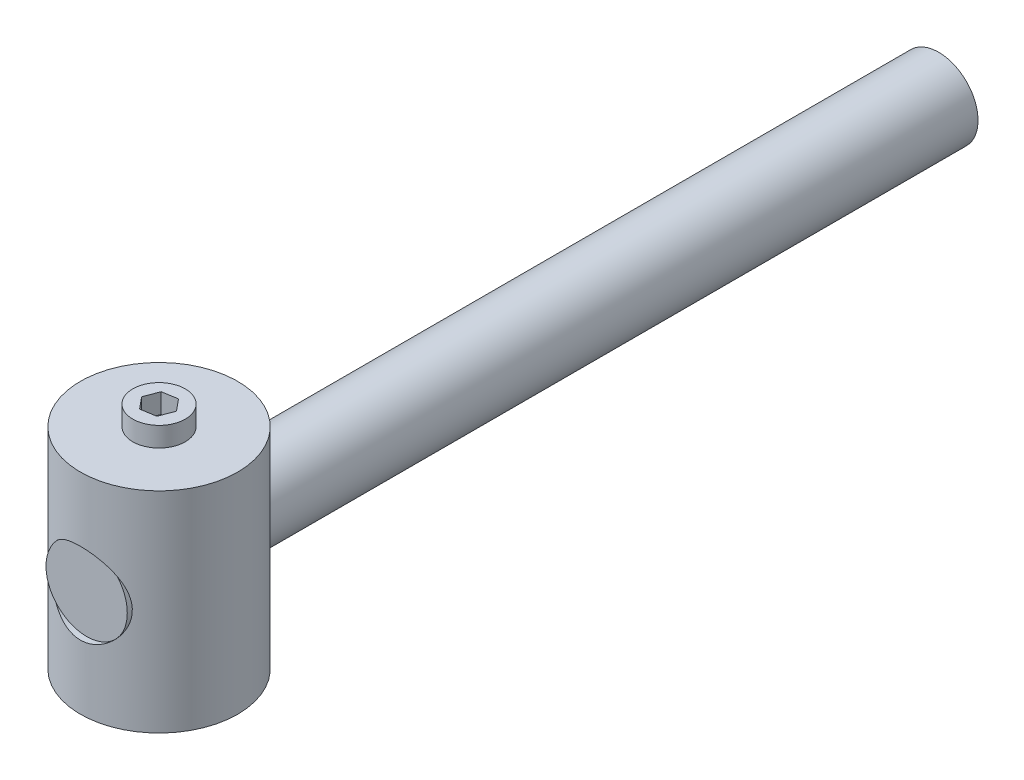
ISO-10303-21;
HEADER;
FILE_DESCRIPTION(('STEP AP214'),'2;1');
FILE_NAME('part.step','',(''),(''),'','','');
FILE_SCHEMA(('AUTOMOTIVE_DESIGN { 1 0 10303 214 1 1 1 1 }'));
ENDSEC;
DATA;
#1=APPLICATION_CONTEXT('core data for automotive mechanical design processes');
#2=APPLICATION_PROTOCOL_DEFINITION('international standard','automotive_design',2000,#1);
#3=PRODUCT_CONTEXT('',#1,'mechanical');
#4=PRODUCT('Part','Part','',(#3));
#5=PRODUCT_RELATED_PRODUCT_CATEGORY('part','',(#4));
#6=PRODUCT_DEFINITION_FORMATION('','',#4);
#7=PRODUCT_DEFINITION_CONTEXT('part definition',#1,'design');
#8=PRODUCT_DEFINITION('design','',#6,#7);
#9=PRODUCT_DEFINITION_SHAPE('','',#8);
#10=(LENGTH_UNIT() NAMED_UNIT(*) SI_UNIT(.MILLI.,.METRE.));
#11=(NAMED_UNIT(*) PLANE_ANGLE_UNIT() SI_UNIT($,.RADIAN.));
#12=(NAMED_UNIT(*) SI_UNIT($,.STERADIAN.) SOLID_ANGLE_UNIT());
#13=UNCERTAINTY_MEASURE_WITH_UNIT(LENGTH_MEASURE(1.E-05),#10,'distance_accuracy_value','');
#14=(GEOMETRIC_REPRESENTATION_CONTEXT(3) GLOBAL_UNCERTAINTY_ASSIGNED_CONTEXT((#13)) GLOBAL_UNIT_ASSIGNED_CONTEXT((#10,
#11,#12)) REPRESENTATION_CONTEXT('',''));
#15=CARTESIAN_POINT('',(0.,0.,0.));
#16=DIRECTION('',(0.,0.,1.));
#17=DIRECTION('',(1.,0.,0.));
#18=AXIS2_PLACEMENT_3D('',#15,#16,#17);
#19=CARTESIAN_POINT('',(0.,-8.,0.));
#20=DIRECTION('',(0.,1.,0.));
#21=DIRECTION('',(-1.,0.,0.));
#22=AXIS2_PLACEMENT_3D('',#19,#20,#21);
#23=CYLINDRICAL_SURFACE('',#22,6.);
#24=CARTESIAN_POINT('',(0.,-8.,0.));
#25=DIRECTION('',(0.,-1.,0.));
#26=DIRECTION('',(1.,0.,0.));
#27=AXIS2_PLACEMENT_3D('',#24,#25,#26);
#28=CIRCLE('',#27,6.);
#29=CARTESIAN_POINT('',(6.,-8.,0.));
#30=VERTEX_POINT('',#29);
#31=EDGE_CURVE('E170',#30,#30,#28,.T.);
#32=ORIENTED_EDGE('',*,*,#31,.F.);
#33=EDGE_LOOP('',(#32));
#34=FACE_BOUND('',#33,.T.);
#35=CARTESIAN_POINT('',(0.,8.,0.));
#36=DIRECTION('',(0.,-1.,0.));
#37=DIRECTION('',(1.,0.,0.));
#38=AXIS2_PLACEMENT_3D('',#35,#36,#37);
#39=CIRCLE('',#38,6.);
#40=CARTESIAN_POINT('',(6.,8.,0.));
#41=VERTEX_POINT('',#40);
#42=EDGE_CURVE('E139',#41,#41,#39,.T.);
#43=ORIENTED_EDGE('',*,*,#42,.T.);
#44=EDGE_LOOP('',(#43));
#45=FACE_BOUND('',#44,.T.);
#46=CARTESIAN_POINT('',(2.34445537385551,2.02818367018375,5.523));
#47=CARTESIAN_POINT('',(2.28783362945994,2.09362143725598,5.54703549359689));
#48=CARTESIAN_POINT('',(2.22853125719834,2.15664409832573,5.57117975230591));
#49=CARTESIAN_POINT('',(2.10476972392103,2.27759795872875,5.61910633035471));
#50=CARTESIAN_POINT('',(2.04030890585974,2.33552750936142,5.6428885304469));
#51=CARTESIAN_POINT('',(1.83907285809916,2.50161967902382,5.712965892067));
#52=CARTESIAN_POINT('',(1.69485367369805,2.60161177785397,5.75781077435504));
#53=CARTESIAN_POINT('',(1.38936467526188,2.77682642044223,5.83906800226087));
#54=CARTESIAN_POINT('',(1.22804995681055,2.85198148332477,5.87545729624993));
#55=CARTESIAN_POINT('',(0.893089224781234,2.97388918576,5.9355870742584));
#56=CARTESIAN_POINT('',(0.719472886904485,3.02070774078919,5.95935689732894));
#57=CARTESIAN_POINT('',(0.37896811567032,3.08122759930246,5.99027109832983));
#58=CARTESIAN_POINT('',(0.212585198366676,3.09719380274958,5.99855093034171));
#59=CARTESIAN_POINT('',(-0.120731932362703,3.10212575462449,6.00109752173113));
#60=CARTESIAN_POINT('',(-0.287666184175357,3.09108958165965,5.99536328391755));
#61=CARTESIAN_POINT('',(-0.605511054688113,3.04424686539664,5.97135508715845));
#62=CARTESIAN_POINT('',(-0.756745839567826,3.01014968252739,5.95394713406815));
#63=CARTESIAN_POINT('',(-1.05111942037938,2.9204171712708,5.90908886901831));
#64=CARTESIAN_POINT('',(-1.19425548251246,2.86477461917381,5.8816351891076));
#65=CARTESIAN_POINT('',(-1.47577324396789,2.73084859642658,5.8175524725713));
#66=CARTESIAN_POINT('',(-1.61362361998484,2.65163191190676,5.7805558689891));
#67=CARTESIAN_POINT('',(-1.87455844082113,2.4740471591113,5.70128135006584));
#68=CARTESIAN_POINT('',(-1.99765355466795,2.37569306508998,5.65900729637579));
#69=CARTESIAN_POINT('',(-2.15323350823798,2.23085465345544,5.60049150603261));
#70=CARTESIAN_POINT('',(-2.19305136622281,2.19172196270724,5.58500415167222));
#71=CARTESIAN_POINT('',(-2.27043195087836,2.11145322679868,5.55399565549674));
#72=CARTESIAN_POINT('',(-2.30799879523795,2.07032110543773,5.53847463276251));
#73=CARTESIAN_POINT('',(-2.34445537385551,2.02818367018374,5.523));
#74=B_SPLINE_CURVE_WITH_KNOTS('',3,(#46,#47,#48,#49,#50,#51,#52,#53,#54,#55,#56,#57,#58,#59,#60,
#61,#62,#63,#64,#65,#66,#67,#68,#69,#70,#71,#72,#73),.UNSPECIFIED.,.F.,.F.,(4,2,2,2,2,2,2,2,2,2,
2,2,2,4),(0.,0.269274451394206,0.538635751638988,1.07929178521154,1.62140490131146,
2.16225207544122,2.66161136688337,3.16100619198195,3.62693767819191,4.09302551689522,
4.58080576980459,5.06823117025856,5.24198423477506,5.41540909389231),.UNSPECIFIED.);
#75=CARTESIAN_POINT('',(2.34445537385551,2.02818367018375,5.523));
#76=VERTEX_POINT('',#75);
#77=CARTESIAN_POINT('',(-2.34445537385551,2.02818367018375,5.523));
#78=VERTEX_POINT('',#77);
#79=EDGE_CURVE('E9',#76,#78,#74,.T.);
#80=ORIENTED_EDGE('',*,*,#79,.F.);
#81=CARTESIAN_POINT('',(2.34445537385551,2.02818367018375,5.523));
#82=CARTESIAN_POINT('',(2.39916282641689,1.96492519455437,5.49977845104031));
#83=CARTESIAN_POINT('',(2.45131496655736,1.89948269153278,5.476679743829));
#84=CARTESIAN_POINT('',(2.55032402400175,1.76434146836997,5.43128099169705));
#85=CARTESIAN_POINT('',(2.59717562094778,1.69463857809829,5.40898176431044));
#86=CARTESIAN_POINT('',(2.72977964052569,1.47879734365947,5.3439716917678));
#87=CARTESIAN_POINT('',(2.80703731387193,1.32655302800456,5.30338869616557));
#88=CARTESIAN_POINT('',(2.90389845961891,1.08848208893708,5.25059379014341));
#89=CARTESIAN_POINT('',(2.93306480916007,1.00728669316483,5.2343107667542));
#90=CARTESIAN_POINT('',(2.98465339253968,0.84220277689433,5.20506714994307));
#91=CARTESIAN_POINT('',(3.007078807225,0.758315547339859,5.19210498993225));
#92=CARTESIAN_POINT('',(3.04482114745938,0.58872082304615,5.17006210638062));
#93=CARTESIAN_POINT('',(3.06015880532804,0.503019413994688,5.16097006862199));
#94=CARTESIAN_POINT('',(3.08358532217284,0.33029211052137,5.14700781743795));
#95=CARTESIAN_POINT('',(3.0916751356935,0.243266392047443,5.14213704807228));
#96=CARTESIAN_POINT('',(3.10004120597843,0.0772347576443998,5.13709684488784));
#97=CARTESIAN_POINT('',(3.10100294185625,-0.0017249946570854,5.13651499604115));
#98=CARTESIAN_POINT('',(3.09690151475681,-0.159459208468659,5.13898890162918));
#99=CARTESIAN_POINT('',(3.09183623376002,-0.238233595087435,5.14204593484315));
#100=CARTESIAN_POINT('',(3.0757427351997,-0.394988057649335,5.15168855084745));
#101=CARTESIAN_POINT('',(3.06471188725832,-0.472967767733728,5.15827569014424));
#102=CARTESIAN_POINT('',(3.03683586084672,-0.627538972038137,5.17473524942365));
#103=CARTESIAN_POINT('',(3.01998845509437,-0.70412992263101,5.18460892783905));
#104=CARTESIAN_POINT('',(2.96262867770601,-0.92479388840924,5.21773477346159));
#105=CARTESIAN_POINT('',(2.91457832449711,-1.06638392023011,5.24495496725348));
#106=CARTESIAN_POINT('',(2.79952590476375,-1.3396528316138,5.30724920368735));
#107=CARTESIAN_POINT('',(2.73252534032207,-1.47133249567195,5.34232262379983));
#108=CARTESIAN_POINT('',(2.6109347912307,-1.67361921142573,5.40237474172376));
#109=CARTESIAN_POINT('',(2.56174589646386,-1.7479633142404,5.42593385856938));
#110=CARTESIAN_POINT('',(2.45746257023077,-1.89175459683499,5.47395358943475));
#111=CARTESIAN_POINT('',(2.40238429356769,-1.96121434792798,5.49841162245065));
#112=CARTESIAN_POINT('',(2.34445537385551,-2.02818367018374,5.523));
#113=B_SPLINE_CURVE_WITH_KNOTS('',3,(#81,#82,#83,#84,#85,#86,#87,#88,#89,#90,#91,#92,#93,#94,
#95,#96,#97,#98,#99,#100,#101,#102,#103,#104,#105,#106,#107,#108,#109,#110,#111,#112),
.UNSPECIFIED.,.F.,.F.,(4,2,2,2,2,2,2,2,2,2,2,2,2,2,2,4),(0.,0.260218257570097,0.520695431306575,
1.04421374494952,1.30732718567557,1.57031627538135,1.83253115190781,2.09471148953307,
2.33130565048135,2.56798298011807,2.80476475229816,3.04163729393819,3.4955905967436,
3.94950792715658,4.22582428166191,4.50140124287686),.UNSPECIFIED.);
#114=CARTESIAN_POINT('',(2.34445537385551,-2.02818367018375,5.523));
#115=VERTEX_POINT('',#114);
#116=EDGE_CURVE('E93',#76,#115,#113,.T.);
#117=ORIENTED_EDGE('',*,*,#116,.T.);
#118=CARTESIAN_POINT('',(-2.34445537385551,-2.02818367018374,5.523));
#119=CARTESIAN_POINT('',(-2.28783362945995,-2.09362143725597,5.54703549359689));
#120=CARTESIAN_POINT('',(-2.22853125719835,-2.15664409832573,5.57117975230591));
#121=CARTESIAN_POINT('',(-2.10476972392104,-2.27759795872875,5.6191063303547));
#122=CARTESIAN_POINT('',(-2.04030890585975,-2.33552750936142,5.6428885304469));
#123=CARTESIAN_POINT('',(-1.83907285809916,-2.50161967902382,5.712965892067));
#124=CARTESIAN_POINT('',(-1.69485367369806,-2.60161177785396,5.75781077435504));
#125=CARTESIAN_POINT('',(-1.38936467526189,-2.77682642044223,5.83906800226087));
#126=CARTESIAN_POINT('',(-1.22804995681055,-2.85198148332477,5.87545729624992));
#127=CARTESIAN_POINT('',(-0.893089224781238,-2.97388918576,5.9355870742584));
#128=CARTESIAN_POINT('',(-0.719472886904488,-3.02070774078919,5.95935689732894));
#129=CARTESIAN_POINT('',(-0.378968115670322,-3.08122759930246,5.99027109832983));
#130=CARTESIAN_POINT('',(-0.212585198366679,-3.09719380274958,5.99855093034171));
#131=CARTESIAN_POINT('',(0.1207319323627,-3.10212575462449,6.00109752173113));
#132=CARTESIAN_POINT('',(0.287666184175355,-3.09108958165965,5.99536328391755));
#133=CARTESIAN_POINT('',(0.605511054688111,-3.04424686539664,5.97135508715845));
#134=CARTESIAN_POINT('',(0.756745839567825,-3.01014968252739,5.95394713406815));
#135=CARTESIAN_POINT('',(1.05111942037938,-2.9204171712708,5.90908886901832));
#136=CARTESIAN_POINT('',(1.19425548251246,-2.86477461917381,5.8816351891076));
#137=CARTESIAN_POINT('',(1.47577324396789,-2.73084859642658,5.8175524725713));
#138=CARTESIAN_POINT('',(1.61362361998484,-2.65163191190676,5.7805558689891));
#139=CARTESIAN_POINT('',(1.87455844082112,-2.4740471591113,5.70128135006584));
#140=CARTESIAN_POINT('',(1.99765355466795,-2.37569306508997,5.65900729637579));
#141=CARTESIAN_POINT('',(2.15323350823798,-2.23085465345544,5.60049150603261));
#142=CARTESIAN_POINT('',(2.19305136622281,-2.19172196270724,5.58500415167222));
#143=CARTESIAN_POINT('',(2.27043195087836,-2.11145322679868,5.55399565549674));
#144=CARTESIAN_POINT('',(2.30799879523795,-2.07032110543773,5.53847463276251));
#145=CARTESIAN_POINT('',(2.34445537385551,-2.02818367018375,5.523));
#146=B_SPLINE_CURVE_WITH_KNOTS('',3,(#118,#119,#120,#121,#122,#123,#124,#125,#126,#127,#128,
#129,#130,#131,#132,#133,#134,#135,#136,#137,#138,#139,#140,#141,#142,#143,#144,#145),
.UNSPECIFIED.,.F.,.F.,(4,2,2,2,2,2,2,2,2,2,2,2,2,4),(0.,0.269274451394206,0.538635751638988,
1.07929178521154,1.62140490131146,2.16225207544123,2.66161136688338,3.16100619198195,
3.62693767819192,4.09302551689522,4.58080576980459,5.06823117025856,5.24198423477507,
5.41540909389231),.UNSPECIFIED.);
#147=CARTESIAN_POINT('',(-2.34445537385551,-2.02818367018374,5.523));
#148=VERTEX_POINT('',#147);
#149=EDGE_CURVE('E27',#148,#115,#146,.T.);
#150=ORIENTED_EDGE('',*,*,#149,.F.);
#151=CARTESIAN_POINT('',(-2.34445537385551,-2.02818367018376,5.523));
#152=CARTESIAN_POINT('',(-2.39916282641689,-1.96492519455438,5.49977845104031));
#153=CARTESIAN_POINT('',(-2.45131496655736,-1.89948269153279,5.476679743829));
#154=CARTESIAN_POINT('',(-2.55032402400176,-1.76434146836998,5.43128099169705));
#155=CARTESIAN_POINT('',(-2.59717562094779,-1.6946385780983,5.40898176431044));
#156=CARTESIAN_POINT('',(-2.7297796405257,-1.47879734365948,5.3439716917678));
#157=CARTESIAN_POINT('',(-2.80703731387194,-1.32655302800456,5.30338869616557));
#158=CARTESIAN_POINT('',(-2.90389845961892,-1.08848208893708,5.25059379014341));
#159=CARTESIAN_POINT('',(-2.93306480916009,-1.00728669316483,5.23431076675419));
#160=CARTESIAN_POINT('',(-2.9846533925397,-0.84220277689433,5.20506714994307));
#161=CARTESIAN_POINT('',(-3.00707880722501,-0.758315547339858,5.19210498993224));
#162=CARTESIAN_POINT('',(-3.04482114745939,-0.588720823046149,5.17006210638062));
#163=CARTESIAN_POINT('',(-3.06015880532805,-0.503019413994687,5.16097006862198));
#164=CARTESIAN_POINT('',(-3.08358532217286,-0.33029211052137,5.14700781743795));
#165=CARTESIAN_POINT('',(-3.09167513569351,-0.243266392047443,5.14213704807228));
#166=CARTESIAN_POINT('',(-3.10004120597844,-0.0772347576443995,5.13709684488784));
#167=CARTESIAN_POINT('',(-3.10100294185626,0.00172499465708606,5.13651499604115));
#168=CARTESIAN_POINT('',(-3.09690151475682,0.15945920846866,5.13898890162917));
#169=CARTESIAN_POINT('',(-3.09183623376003,0.238233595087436,5.14204593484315));
#170=CARTESIAN_POINT('',(-3.07574273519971,0.394988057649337,5.15168855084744));
#171=CARTESIAN_POINT('',(-3.06471188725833,0.47296776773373,5.15827569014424));
#172=CARTESIAN_POINT('',(-3.03683586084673,0.627538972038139,5.17473524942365));
#173=CARTESIAN_POINT('',(-3.01998845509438,0.704129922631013,5.18460892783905));
#174=CARTESIAN_POINT('',(-2.96262867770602,0.924793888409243,5.21773477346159));
#175=CARTESIAN_POINT('',(-2.91457832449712,1.06638392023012,5.24495496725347));
#176=CARTESIAN_POINT('',(-2.79952590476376,1.3396528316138,5.30724920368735));
#177=CARTESIAN_POINT('',(-2.73252534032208,1.47133249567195,5.34232262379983));
#178=CARTESIAN_POINT('',(-2.61093479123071,1.67361921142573,5.40237474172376));
#179=CARTESIAN_POINT('',(-2.56174589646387,1.7479633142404,5.42593385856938));
#180=CARTESIAN_POINT('',(-2.45746257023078,1.891754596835,5.47395358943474));
#181=CARTESIAN_POINT('',(-2.40238429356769,1.96121434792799,5.49841162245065));
#182=CARTESIAN_POINT('',(-2.34445537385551,2.02818367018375,5.523));
#183=B_SPLINE_CURVE_WITH_KNOTS('',3,(#151,#152,#153,#154,#155,#156,#157,#158,#159,#160,#161,
#162,#163,#164,#165,#166,#167,#168,#169,#170,#171,#172,#173,#174,#175,#176,#177,#178,#179,#180,
#181,#182),.UNSPECIFIED.,.F.,.F.,(4,2,2,2,2,2,2,2,2,2,2,2,2,2,2,4),(0.,0.2602182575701,
0.520695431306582,1.04421374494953,1.30732718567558,1.57031627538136,1.83253115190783,
2.09471148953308,2.33130565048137,2.56798298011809,2.80476475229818,3.04163729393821,
3.49559059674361,3.9495079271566,4.22582428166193,4.50140124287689),.UNSPECIFIED.);
#184=EDGE_CURVE('E96',#148,#78,#183,.T.);
#185=ORIENTED_EDGE('',*,*,#184,.T.);
#186=EDGE_LOOP('',(#80,#117,#150,#185));
#187=FACE_BOUND('',#186,.T.);
#188=CARTESIAN_POINT('',(-1.5,2.5980762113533,-5.8094750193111));
#189=CARTESIAN_POINT('',(-1.65048546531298,2.51118802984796,-5.77061484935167));
#190=CARTESIAN_POINT('',(-1.79279904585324,2.41154971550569,-5.72759214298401));
#191=CARTESIAN_POINT('',(-2.05783193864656,2.1898241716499,-5.63782213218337));
#192=CARTESIAN_POINT('',(-2.18049247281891,2.06767186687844,-5.59106425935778));
#193=CARTESIAN_POINT('',(-2.40323232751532,1.80395143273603,-5.49899737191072));
#194=CARTESIAN_POINT('',(-2.50332999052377,1.6623992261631,-5.45368720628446));
#195=CARTESIAN_POINT('',(-2.678311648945,1.36259500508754,-5.36992539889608));
#196=CARTESIAN_POINT('',(-2.75321998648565,1.20435930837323,-5.33146715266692));
#197=CARTESIAN_POINT('',(-2.84371716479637,0.959499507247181,-5.28340723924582));
#198=CARTESIAN_POINT('',(-2.87005178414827,0.877633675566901,-5.26910596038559));
#199=CARTESIAN_POINT('',(-2.91568779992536,0.711459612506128,-5.24399146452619));
#200=CARTESIAN_POINT('',(-2.93499295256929,0.627152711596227,-5.23317638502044));
#201=CARTESIAN_POINT('',(-2.96627465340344,0.456840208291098,-5.21550968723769));
#202=CARTESIAN_POINT('',(-2.9782566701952,0.370835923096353,-5.20865511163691));
#203=CARTESIAN_POINT('',(-2.99472645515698,0.197910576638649,-5.19920118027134));
#204=CARTESIAN_POINT('',(-2.99921525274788,0.110989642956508,-5.19660124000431));
#205=CARTESIAN_POINT('',(-3.00110636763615,-0.127860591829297,-5.19552108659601));
#206=CARTESIAN_POINT('',(-2.99073537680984,-0.279966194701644,-5.20155454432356));
#207=CARTESIAN_POINT('',(-2.94735140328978,-0.579757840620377,-5.2262508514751));
#208=CARTESIAN_POINT('',(-2.91433353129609,-0.727442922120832,-5.24491642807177));
#209=CARTESIAN_POINT('',(-2.82794406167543,-1.01217039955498,-5.29198300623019));
#210=CARTESIAN_POINT('',(-2.77493360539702,-1.14935249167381,-5.32021041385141));
#211=CARTESIAN_POINT('',(-2.65028160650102,-1.41327114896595,-5.3833889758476));
#212=CARTESIAN_POINT('',(-2.57863335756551,-1.54000393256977,-5.41834254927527));
#213=CARTESIAN_POINT('',(-2.40879601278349,-1.79553893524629,-5.49612742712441));
#214=CARTESIAN_POINT('',(-2.30845926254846,-1.92278113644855,-5.53940101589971));
#215=CARTESIAN_POINT('',(-2.08862891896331,-2.15957303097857,-5.62597472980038));
#216=CARTESIAN_POINT('',(-1.96912344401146,-2.26911166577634,-5.66927485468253));
#217=CARTESIAN_POINT('',(-1.70316480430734,-2.4758280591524,-5.75501517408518));
#218=CARTESIAN_POINT('',(-1.55534190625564,-2.57139317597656,-5.79712948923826));
#219=CARTESIAN_POINT('',(-1.24336720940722,-2.7358874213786,-5.87194191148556));
#220=CARTESIAN_POINT('',(-1.07922456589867,-2.80483137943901,-5.90464525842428));
#221=CARTESIAN_POINT('',(-0.749782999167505,-2.90961100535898,-5.95515420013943));
#222=CARTESIAN_POINT('',(-0.585172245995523,-2.94721771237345,-5.97375039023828));
#223=CARTESIAN_POINT('',(-0.251044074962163,-2.99422506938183,-5.99707841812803));
#224=CARTESIAN_POINT('',(-0.0815300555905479,-3.00364480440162,-6.00181963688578));
#225=CARTESIAN_POINT('',(0.240776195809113,-2.99426123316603,-5.99713332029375));
#226=CARTESIAN_POINT('',(0.39366839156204,-2.97798142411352,-5.98897254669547));
#227=CARTESIAN_POINT('',(0.694209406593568,-2.92257125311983,-5.96161412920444));
#228=CARTESIAN_POINT('',(0.841858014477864,-2.88343997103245,-5.94241604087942));
#229=CARTESIAN_POINT('',(1.12860650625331,-2.78377009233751,-5.89469804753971));
#230=CARTESIAN_POINT('',(1.26767822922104,-2.72316497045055,-5.8661491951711));
#231=CARTESIAN_POINT('',(1.53392642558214,-2.58258769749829,-5.80222735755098));
#232=CARTESIAN_POINT('',(1.66109910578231,-2.50260939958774,-5.76685220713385));
#233=CARTESIAN_POINT('',(1.91230443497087,-2.31724220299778,-5.68875414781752));
#234=CARTESIAN_POINT('',(2.03500603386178,-2.21020647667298,-5.64565580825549));
#235=CARTESIAN_POINT('',(2.26151275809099,-1.9778630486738,-5.55880430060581));
#236=CARTESIAN_POINT('',(2.36530298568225,-1.85254108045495,-5.51505064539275));
#237=CARTESIAN_POINT('',(2.55860715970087,-1.57605019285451,-5.42821969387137));
#238=CARTESIAN_POINT('',(2.64653751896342,-1.42366530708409,-5.38542213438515));
#239=CARTESIAN_POINT('',(2.75788925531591,-1.1839915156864,-5.32876942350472));
#240=CARTESIAN_POINT('',(2.7915892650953,-1.10222573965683,-5.3111384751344));
#241=CARTESIAN_POINT('',(2.85178570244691,-0.935498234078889,-5.27906071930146));
#242=CARTESIAN_POINT('',(2.87828645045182,-0.85053845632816,-5.26461200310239));
#243=CARTESIAN_POINT('',(2.9222372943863,-0.683722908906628,-5.24033573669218));
#244=CARTESIAN_POINT('',(2.94016631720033,-0.602028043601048,-5.23026758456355));
#245=CARTESIAN_POINT('',(2.96916668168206,-0.437098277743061,-5.21385916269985));
#246=CARTESIAN_POINT('',(2.98024164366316,-0.35386421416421,-5.20751692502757));
#247=CARTESIAN_POINT('',(2.99536791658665,-0.186589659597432,-5.19883163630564));
#248=CARTESIAN_POINT('',(2.99942293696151,-0.10254961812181,-5.19648647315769));
#249=CARTESIAN_POINT('',(3.00046305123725,0.0655614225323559,-5.19588419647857));
#250=CARTESIAN_POINT('',(2.99744875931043,0.149632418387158,-5.19762672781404));
#251=CARTESIAN_POINT('',(2.97937157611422,0.381110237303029,-5.20803059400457));
#252=CARTESIAN_POINT('',(2.95686194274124,0.527824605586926,-5.22096138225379));
#253=CARTESIAN_POINT('',(2.89095355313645,0.814953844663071,-5.25773385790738));
#254=CARTESIAN_POINT('',(2.84754810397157,0.955366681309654,-5.28157904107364));
#255=CARTESIAN_POINT('',(2.73988128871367,1.23110361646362,-5.33824370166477));
#256=CARTESIAN_POINT('',(2.67502411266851,1.36614182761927,-5.3713147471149));
#257=CARTESIAN_POINT('',(2.52674875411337,1.6241021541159,-5.44263730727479));
#258=CARTESIAN_POINT('',(2.44332185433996,1.74701853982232,-5.48089125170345));
#259=CARTESIAN_POINT('',(2.24791640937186,1.99365439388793,-5.56412751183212));
#260=CARTESIAN_POINT('',(2.13365762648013,2.11549428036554,-5.60934742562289));
#261=CARTESIAN_POINT('',(1.8859749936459,2.3390038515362,-5.69740071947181));
#262=CARTESIAN_POINT('',(1.75254264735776,2.44066454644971,-5.74023302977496));
#263=CARTESIAN_POINT('',(1.46336009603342,2.62470942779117,-5.82082237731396));
#264=CARTESIAN_POINT('',(1.30692598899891,2.70614881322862,-5.85830443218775));
#265=CARTESIAN_POINT('',(0.980212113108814,2.84083229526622,-5.92172101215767));
#266=CARTESIAN_POINT('',(0.809944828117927,2.89410149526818,-5.94766581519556));
#267=CARTESIAN_POINT('',(0.476134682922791,2.9664644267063,-5.98322782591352));
#268=CARTESIAN_POINT('',(0.313273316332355,2.98810382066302,-5.9940575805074));
#269=CARTESIAN_POINT('',(-0.0141714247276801,3.00443638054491,-6.00221425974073));
#270=CARTESIAN_POINT('',(-0.178754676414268,2.99913145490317,-5.99954214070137));
#271=CARTESIAN_POINT('',(-0.49203275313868,2.96326587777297,-5.98170058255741));
#272=CARTESIAN_POINT('',(-0.641005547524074,2.93459240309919,-5.96746523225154));
#273=CARTESIAN_POINT('',(-0.931578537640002,2.85565624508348,-5.92904599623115));
#274=CARTESIAN_POINT('',(-1.07318912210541,2.80542496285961,-5.90487658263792));
#275=CARTESIAN_POINT('',(-1.25938054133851,2.72340721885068,-5.86656440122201));
#276=CARTESIAN_POINT('',(-1.3085715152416,2.70010955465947,-5.8557761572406));
#277=CARTESIAN_POINT('',(-1.40543913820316,2.65097876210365,-5.83328480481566));
#278=CARTESIAN_POINT('',(-1.45311616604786,2.6251462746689,-5.82158192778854));
#279=CARTESIAN_POINT('',(-1.5,2.5980762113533,-5.8094750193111));
#280=B_SPLINE_CURVE_WITH_KNOTS('',3,(#188,#189,#190,#191,#192,#193,#194,#195,#196,#197,#198,
#199,#200,#201,#202,#203,#204,#205,#206,#207,#208,#209,#210,#211,#212,#213,#214,#215,#216,#217,
#218,#219,#220,#221,#222,#223,#224,#225,#226,#227,#228,#229,#230,#231,#232,#233,#234,#235,#236,
#237,#238,#239,#240,#241,#242,#243,#244,#245,#246,#247,#248,#249,#250,#251,#252,#253,#254,#255,
#256,#257,#258,#259,#260,#261,#262,#263,#264,#265,#266,#267,#268,#269,#270,#271,#272,#273,#274,
#275,#276,#277,#278,#279),.UNSPECIFIED.,.T.,.F.,(4,2,2,2,2,2,2,2,2,2,2,2,2,2,2,2,2,2,2,2,2,2,2,
2,2,2,2,2,2,2,2,2,2,2,2,2,2,2,2,2,2,2,2,2,2,4),(0.,0.533971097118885,1.06951052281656,
1.6046129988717,2.13919687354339,2.40041194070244,2.66148722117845,2.9223673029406,
3.18321154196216,3.63843180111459,4.09375037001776,4.54121014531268,4.98883115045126,
5.48990382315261,5.99128829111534,6.53147461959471,7.07135959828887,7.57813712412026,
8.08457143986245,8.54428558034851,9.00401823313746,9.46518775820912,9.92650379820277,
10.4296623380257,10.9332155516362,11.473328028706,11.7435396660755,12.0135887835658,
12.2659591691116,12.5181961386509,12.7702997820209,13.0223815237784,13.467089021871,
13.9119390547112,14.370359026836,14.8289946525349,15.3458627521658,15.8629606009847,
16.4009511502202,16.9384614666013,17.4297340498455,17.9209718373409,18.3760617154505,
18.8304909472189,18.9968919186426,19.163250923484),.UNSPECIFIED.);
#281=CARTESIAN_POINT('',(-1.5,2.5980762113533,-5.8094750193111));
#282=VERTEX_POINT('',#281);
#283=EDGE_CURVE('E133',#282,#282,#280,.T.);
#284=ORIENTED_EDGE('',*,*,#283,.T.);
#285=EDGE_LOOP('',(#284));
#286=FACE_BOUND('',#285,.T.);
#287=ADVANCED_FACE('F14',(#34,#45,#187,#286),#23,.T.);
#288=CARTESIAN_POINT('',(0.,0.,5.523));
#289=DIRECTION('',(0.,0.,1.));
#290=DIRECTION('',(1.,0.,0.));
#291=AXIS2_PLACEMENT_3D('',#288,#289,#290);
#292=PLANE('',#291);
#293=CARTESIAN_POINT('',(0.,0.,5.523));
#294=DIRECTION('',(0.,0.,1.));
#295=DIRECTION('',(1.,0.,0.));
#296=AXIS2_PLACEMENT_3D('',#293,#294,#295);
#297=CIRCLE('',#296,3.1);
#298=EDGE_CURVE('E100',#115,#76,#297,.T.);
#299=ORIENTED_EDGE('',*,*,#298,.T.);
#300=CARTESIAN_POINT('',(0.,0.,5.523));
#301=DIRECTION('',(0.,0.,1.));
#302=DIRECTION('',(1.,0.,0.));
#303=AXIS2_PLACEMENT_3D('',#300,#301,#302);
#304=CIRCLE('',#303,3.1);
#305=EDGE_CURVE('E34',#76,#78,#304,.T.);
#306=ORIENTED_EDGE('',*,*,#305,.T.);
#307=EDGE_CURVE('E101',#78,#148,#297,.T.);
#308=ORIENTED_EDGE('',*,*,#307,.T.);
#309=EDGE_CURVE('E86',#148,#115,#304,.T.);
#310=ORIENTED_EDGE('',*,*,#309,.T.);
#311=EDGE_LOOP('',(#299,#306,#308,#310));
#312=FACE_BOUND('',#311,.T.);
#313=ADVANCED_FACE('F104',(#312),#292,.T.);
#314=CARTESIAN_POINT('',(0.,0.,-5.477));
#315=DIRECTION('',(0.,0.,1.));
#316=DIRECTION('',(1.,0.,0.));
#317=AXIS2_PLACEMENT_3D('',#314,#315,#316);
#318=CYLINDRICAL_SURFACE('',#317,3.1);
#319=ORIENTED_EDGE('',*,*,#116,.F.);
#320=ORIENTED_EDGE('',*,*,#298,.F.);
#321=EDGE_LOOP('',(#319,#320));
#322=FACE_BOUND('',#321,.T.);
#323=ADVANCED_FACE('F99',(#322),#318,.T.);
#324=ORIENTED_EDGE('',*,*,#184,.F.);
#325=ORIENTED_EDGE('',*,*,#307,.F.);
#326=EDGE_LOOP('',(#324,#325));
#327=FACE_BOUND('',#326,.T.);
#328=ADVANCED_FACE('F119',(#327),#318,.T.);
#329=CARTESIAN_POINT('',(0.,0.,-9.477));
#330=DIRECTION('',(0.,0.,-1.));
#331=DIRECTION('',(-0.5,0.866025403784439,0.));
#332=AXIS2_PLACEMENT_3D('',#329,#330,#331);
#333=CYLINDRICAL_SURFACE('',#332,3.);
#334=ORIENTED_EDGE('',*,*,#283,.F.);
#335=EDGE_LOOP('',(#334));
#336=FACE_BOUND('',#335,.T.);
#337=CARTESIAN_POINT('',(0.,0.,-59.477));
#338=DIRECTION('',(0.,0.,1.));
#339=DIRECTION('',(0.5,-0.866025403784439,0.));
#340=AXIS2_PLACEMENT_3D('',#337,#338,#339);
#341=CIRCLE('',#340,3.);
#342=CARTESIAN_POINT('',(1.49999999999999,-2.59807621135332,-59.477));
#343=VERTEX_POINT('',#342);
#344=EDGE_CURVE('E85',#343,#343,#341,.F.);
#345=ORIENTED_EDGE('',*,*,#344,.F.);
#346=EDGE_LOOP('',(#345));
#347=FACE_BOUND('',#346,.T.);
#348=ADVANCED_FACE('F124',(#336,#347),#333,.T.);
#349=CARTESIAN_POINT('',(-2.5,4.3301270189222,-59.477));
#350=DIRECTION('',(0.,0.,1.));
#351=DIRECTION('',(0.5,-0.866025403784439,0.));
#352=AXIS2_PLACEMENT_3D('',#349,#350,#351);
#353=PLANE('',#352);
#354=ORIENTED_EDGE('',*,*,#344,.T.);
#355=EDGE_LOOP('',(#354));
#356=FACE_BOUND('',#355,.T.);
#357=ADVANCED_FACE('F150',(#356),#353,.F.);
#358=CARTESIAN_POINT('',(-0.731297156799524,8.,-0.893609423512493));
#359=DIRECTION('',(0.,-1.,0.));
#360=DIRECTION('',(0.986868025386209,0.,-0.16152863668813));
#361=AXIS2_PLACEMENT_3D('',#358,#359,#360);
#362=PLANE('',#361);
#363=DIRECTION('',(-0.353546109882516,0.,0.935417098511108));
#364=VECTOR('',#363,1.);
#365=CARTESIAN_POINT('',(-0.731297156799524,8.,-0.893609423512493));
#366=LINE('',#365,#364);
#367=CARTESIAN_POINT('',(-0.731297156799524,8.,-0.893609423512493));
#368=VERTEX_POINT('',#367);
#369=CARTESIAN_POINT('',(-1.13953704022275,8.,0.186517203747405));
#370=VERTEX_POINT('',#369);
#371=EDGE_CURVE('E192',#368,#370,#366,.T.);
#372=ORIENTED_EDGE('',*,*,#371,.T.);
#373=DIRECTION('',(0.633321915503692,0.,0.773888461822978));
#374=VECTOR('',#373,1.);
#375=CARTESIAN_POINT('',(-1.13953704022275,8.,0.186517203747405));
#376=LINE('',#375,#374);
#377=CARTESIAN_POINT('',(-0.408239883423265,8.,1.08012662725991));
#378=VERTEX_POINT('',#377);
#379=EDGE_CURVE('E195',#370,#378,#376,.T.);
#380=ORIENTED_EDGE('',*,*,#379,.T.);
#381=DIRECTION('',(0.986868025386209,0.,-0.161528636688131));
#382=VECTOR('',#381,1.);
#383=CARTESIAN_POINT('',(-0.408239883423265,8.,1.08012662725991));
#384=LINE('',#383,#382);
#385=CARTESIAN_POINT('',(0.731297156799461,8.,0.893609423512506));
#386=VERTEX_POINT('',#385);
#387=EDGE_CURVE('E198',#378,#386,#384,.T.);
#388=ORIENTED_EDGE('',*,*,#387,.T.);
#389=DIRECTION('',(0.353546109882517,0.,-0.935417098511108));
#390=VECTOR('',#389,1.);
#391=CARTESIAN_POINT('',(0.731297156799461,8.,0.893609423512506));
#392=LINE('',#391,#390);
#393=CARTESIAN_POINT('',(1.13953704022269,8.,-0.186517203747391));
#394=VERTEX_POINT('',#393);
#395=EDGE_CURVE('E201',#386,#394,#392,.T.);
#396=ORIENTED_EDGE('',*,*,#395,.T.);
#397=DIRECTION('',(-0.633321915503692,0.,-0.773888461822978));
#398=VECTOR('',#397,1.);
#399=CARTESIAN_POINT('',(1.13953704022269,8.,-0.186517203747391));
#400=LINE('',#399,#398);
#401=CARTESIAN_POINT('',(0.408239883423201,8.,-1.08012662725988));
#402=VERTEX_POINT('',#401);
#403=EDGE_CURVE('E204',#394,#402,#400,.T.);
#404=ORIENTED_EDGE('',*,*,#403,.T.);
#405=DIRECTION('',(-0.986868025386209,0.,0.16152863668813));
#406=VECTOR('',#405,1.);
#407=CARTESIAN_POINT('',(0.408239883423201,8.,-1.08012662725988));
#408=LINE('',#407,#406);
#409=EDGE_CURVE('E207',#402,#368,#408,.T.);
#410=ORIENTED_EDGE('',*,*,#409,.T.);
#411=EDGE_LOOP('',(#372,#380,#388,#396,#404,#410));
#412=FACE_BOUND('',#411,.T.);
#413=ADVANCED_FACE('F153',(#412),#362,.F.);
#414=CARTESIAN_POINT('',(-0.408239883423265,8.,1.08012662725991));
#415=DIRECTION('',(0.161528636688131,0.,0.986868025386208));
#416=DIRECTION('',(0.986868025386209,0.,-0.161528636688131));
#417=AXIS2_PLACEMENT_3D('',#414,#415,#416);
#418=PLANE('',#417);
#419=DIRECTION('',(0.986868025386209,0.,-0.161528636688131));
#420=VECTOR('',#419,1.);
#421=CARTESIAN_POINT('',(-0.40823988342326,9.5,1.08012662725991));
#422=LINE('',#421,#420);
#423=CARTESIAN_POINT('',(-0.40823988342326,9.5,1.08012662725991));
#424=VERTEX_POINT('',#423);
#425=CARTESIAN_POINT('',(0.731297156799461,9.5,0.893609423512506));
#426=VERTEX_POINT('',#425);
#427=EDGE_CURVE('E180',#424,#426,#422,.T.);
#428=ORIENTED_EDGE('',*,*,#427,.T.);
#429=DIRECTION('',(0.,1.,0.));
#430=VECTOR('',#429,1.);
#431=CARTESIAN_POINT('',(0.731297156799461,8.,0.893609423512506));
#432=LINE('',#431,#430);
#433=EDGE_CURVE('E218',#386,#426,#432,.T.);
#434=ORIENTED_EDGE('',*,*,#433,.F.);
#435=ORIENTED_EDGE('',*,*,#387,.F.);
#436=DIRECTION('',(0.,1.,0.));
#437=VECTOR('',#436,1.);
#438=CARTESIAN_POINT('',(-0.408239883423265,8.,1.08012662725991));
#439=LINE('',#438,#437);
#440=EDGE_CURVE('E220',#378,#424,#439,.T.);
#441=ORIENTED_EDGE('',*,*,#440,.T.);
#442=EDGE_LOOP('',(#428,#434,#435,#441));
#443=FACE_BOUND('',#442,.T.);
#444=ADVANCED_FACE('F248',(#443),#418,.F.);
#445=CARTESIAN_POINT('',(0.731297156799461,8.,0.893609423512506));
#446=DIRECTION('',(0.935417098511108,0.,0.353546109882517));
#447=DIRECTION('',(0.353546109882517,0.,-0.935417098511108));
#448=AXIS2_PLACEMENT_3D('',#445,#446,#447);
#449=PLANE('',#448);
#450=DIRECTION('',(0.353546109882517,0.,-0.935417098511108));
#451=VECTOR('',#450,1.);
#452=CARTESIAN_POINT('',(0.731297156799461,9.5,0.893609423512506));
#453=LINE('',#452,#451);
#454=CARTESIAN_POINT('',(1.13953704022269,9.5,-0.186517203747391));
#455=VERTEX_POINT('',#454);
#456=EDGE_CURVE('E183',#426,#455,#453,.T.);
#457=ORIENTED_EDGE('',*,*,#456,.T.);
#458=DIRECTION('',(0.,1.,0.));
#459=VECTOR('',#458,1.);
#460=CARTESIAN_POINT('',(1.13953704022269,8.,-0.186517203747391));
#461=LINE('',#460,#459);
#462=EDGE_CURVE('E216',#394,#455,#461,.T.);
#463=ORIENTED_EDGE('',*,*,#462,.F.);
#464=ORIENTED_EDGE('',*,*,#395,.F.);
#465=ORIENTED_EDGE('',*,*,#433,.T.);
#466=EDGE_LOOP('',(#457,#463,#464,#465));
#467=FACE_BOUND('',#466,.T.);
#468=ADVANCED_FACE('F251',(#467),#449,.F.);
#469=CARTESIAN_POINT('',(1.13953704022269,8.,-0.186517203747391));
#470=DIRECTION('',(0.773888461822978,0.,-0.633321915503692));
#471=DIRECTION('',(-0.633321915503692,0.,-0.773888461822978));
#472=AXIS2_PLACEMENT_3D('',#469,#470,#471);
#473=PLANE('',#472);
#474=DIRECTION('',(-0.633321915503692,0.,-0.773888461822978));
#475=VECTOR('',#474,1.);
#476=CARTESIAN_POINT('',(1.13953704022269,9.5,-0.186517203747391));
#477=LINE('',#476,#475);
#478=CARTESIAN_POINT('',(0.408239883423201,9.5,-1.08012662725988));
#479=VERTEX_POINT('',#478);
#480=EDGE_CURVE('E186',#455,#479,#477,.T.);
#481=ORIENTED_EDGE('',*,*,#480,.T.);
#482=DIRECTION('',(0.,1.,0.));
#483=VECTOR('',#482,1.);
#484=CARTESIAN_POINT('',(0.408239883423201,8.,-1.08012662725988));
#485=LINE('',#484,#483);
#486=EDGE_CURVE('E214',#402,#479,#485,.T.);
#487=ORIENTED_EDGE('',*,*,#486,.F.);
#488=ORIENTED_EDGE('',*,*,#403,.F.);
#489=ORIENTED_EDGE('',*,*,#462,.T.);
#490=EDGE_LOOP('',(#481,#487,#488,#489));
#491=FACE_BOUND('',#490,.T.);
#492=ADVANCED_FACE('F255',(#491),#473,.F.);
#493=CARTESIAN_POINT('',(0.408239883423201,8.,-1.08012662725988));
#494=DIRECTION('',(-0.161528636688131,0.,-0.986868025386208));
#495=DIRECTION('',(-0.986868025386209,0.,0.16152863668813));
#496=AXIS2_PLACEMENT_3D('',#493,#494,#495);
#497=PLANE('',#496);
#498=DIRECTION('',(-0.986868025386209,0.,0.16152863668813));
#499=VECTOR('',#498,1.);
#500=CARTESIAN_POINT('',(0.408239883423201,9.5,-1.08012662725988));
#501=LINE('',#500,#499);
#502=CARTESIAN_POINT('',(-0.731297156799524,9.5,-0.893609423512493));
#503=VERTEX_POINT('',#502);
#504=EDGE_CURVE('E189',#479,#503,#501,.T.);
#505=ORIENTED_EDGE('',*,*,#504,.T.);
#506=DIRECTION('',(0.,1.,0.));
#507=VECTOR('',#506,1.);
#508=CARTESIAN_POINT('',(-0.731297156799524,8.,-0.893609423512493));
#509=LINE('',#508,#507);
#510=EDGE_CURVE('E211',#368,#503,#509,.T.);
#511=ORIENTED_EDGE('',*,*,#510,.F.);
#512=ORIENTED_EDGE('',*,*,#409,.F.);
#513=ORIENTED_EDGE('',*,*,#486,.T.);
#514=EDGE_LOOP('',(#505,#511,#512,#513));
#515=FACE_BOUND('',#514,.T.);
#516=ADVANCED_FACE('F244',(#515),#497,.F.);
#517=CARTESIAN_POINT('',(-0.731297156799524,8.,-0.893609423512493));
#518=DIRECTION('',(-0.935417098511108,0.,-0.353546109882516));
#519=DIRECTION('',(-0.353546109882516,0.,0.935417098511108));
#520=AXIS2_PLACEMENT_3D('',#517,#518,#519);
#521=PLANE('',#520);
#522=DIRECTION('',(-0.353546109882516,0.,0.935417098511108));
#523=VECTOR('',#522,1.);
#524=CARTESIAN_POINT('',(-0.731297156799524,9.5,-0.893609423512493));
#525=LINE('',#524,#523);
#526=CARTESIAN_POINT('',(-1.13953704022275,9.5,0.186517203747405));
#527=VERTEX_POINT('',#526);
#528=EDGE_CURVE('E41',#503,#527,#525,.T.);
#529=ORIENTED_EDGE('',*,*,#528,.T.);
#530=DIRECTION('',(0.,1.,0.));
#531=VECTOR('',#530,1.);
#532=CARTESIAN_POINT('',(-1.13953704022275,8.,0.186517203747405));
#533=LINE('',#532,#531);
#534=EDGE_CURVE('E210',#370,#527,#533,.T.);
#535=ORIENTED_EDGE('',*,*,#534,.F.);
#536=ORIENTED_EDGE('',*,*,#371,.F.);
#537=ORIENTED_EDGE('',*,*,#510,.T.);
#538=EDGE_LOOP('',(#529,#535,#536,#537));
#539=FACE_BOUND('',#538,.T.);
#540=ADVANCED_FACE('F241',(#539),#521,.F.);
#541=CARTESIAN_POINT('',(-1.13953704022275,8.,0.186517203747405));
#542=DIRECTION('',(-0.773888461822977,0.,0.633321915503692));
#543=DIRECTION('',(0.633321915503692,0.,0.773888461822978));
#544=AXIS2_PLACEMENT_3D('',#541,#542,#543);
#545=PLANE('',#544);
#546=DIRECTION('',(0.633321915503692,0.,0.773888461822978));
#547=VECTOR('',#546,1.);
#548=CARTESIAN_POINT('',(-1.13953704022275,9.5,0.186517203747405));
#549=LINE('',#548,#547);
#550=EDGE_CURVE('E177',#527,#424,#549,.T.);
#551=ORIENTED_EDGE('',*,*,#550,.T.);
#552=ORIENTED_EDGE('',*,*,#440,.F.);
#553=ORIENTED_EDGE('',*,*,#379,.F.);
#554=ORIENTED_EDGE('',*,*,#534,.T.);
#555=EDGE_LOOP('',(#551,#552,#553,#554));
#556=FACE_BOUND('',#555,.T.);
#557=ADVANCED_FACE('F237',(#556),#545,.F.);
#558=CARTESIAN_POINT('',(0.,9.5,0.));
#559=DIRECTION('',(0.,-1.,0.));
#560=DIRECTION('',(0.986868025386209,0.,-0.16152863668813));
#561=AXIS2_PLACEMENT_3D('',#558,#559,#560);
#562=PLANE('',#561);
#563=ORIENTED_EDGE('',*,*,#550,.F.);
#564=ORIENTED_EDGE('',*,*,#528,.F.);
#565=ORIENTED_EDGE('',*,*,#504,.F.);
#566=ORIENTED_EDGE('',*,*,#480,.F.);
#567=ORIENTED_EDGE('',*,*,#456,.F.);
#568=ORIENTED_EDGE('',*,*,#427,.F.);
#569=EDGE_LOOP('',(#563,#564,#565,#566,#567,#568));
#570=FACE_BOUND('',#569,.T.);
#571=CARTESIAN_POINT('',(0.,9.5,0.));
#572=DIRECTION('',(0.,-1.,0.));
#573=DIRECTION('',(0.986868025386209,0.,-0.16152863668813));
#574=AXIS2_PLACEMENT_3D('',#571,#572,#573);
#575=CIRCLE('',#574,2.);
#576=CARTESIAN_POINT('',(1.97373605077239,9.5,-0.32305727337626));
#577=VERTEX_POINT('',#576);
#578=EDGE_CURVE('E213',#577,#577,#575,.T.);
#579=ORIENTED_EDGE('',*,*,#578,.F.);
#580=EDGE_LOOP('',(#579));
#581=FACE_BOUND('',#580,.T.);
#582=ADVANCED_FACE('F231',(#570,#581),#562,.F.);
#583=CARTESIAN_POINT('',(0.,5.5,0.));
#584=DIRECTION('',(0.,-1.,0.));
#585=DIRECTION('',(0.986868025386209,0.,-0.16152863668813));
#586=AXIS2_PLACEMENT_3D('',#583,#584,#585);
#587=CYLINDRICAL_SURFACE('',#586,2.);
#588=ORIENTED_EDGE('',*,*,#578,.T.);
#589=EDGE_LOOP('',(#588));
#590=FACE_BOUND('',#589,.T.);
#591=CARTESIAN_POINT('',(0.,8.,0.));
#592=DIRECTION('',(0.,-1.,0.));
#593=DIRECTION('',(0.,0.,1.));
#594=AXIS2_PLACEMENT_3D('',#591,#592,#593);
#595=CIRCLE('',#594,2.);
#596=CARTESIAN_POINT('',(0.,8.,2.));
#597=VERTEX_POINT('',#596);
#598=EDGE_CURVE('E140',#597,#597,#595,.T.);
#599=ORIENTED_EDGE('',*,*,#598,.F.);
#600=EDGE_LOOP('',(#599));
#601=FACE_BOUND('',#600,.T.);
#602=ADVANCED_FACE('F229',(#590,#601),#587,.T.);
#603=CARTESIAN_POINT('',(0.,8.,0.));
#604=DIRECTION('',(0.,-1.,0.));
#605=DIRECTION('',(1.,0.,0.));
#606=AXIS2_PLACEMENT_3D('',#603,#604,#605);
#607=PLANE('',#606);
#608=ORIENTED_EDGE('',*,*,#42,.F.);
#609=EDGE_LOOP('',(#608));
#610=FACE_BOUND('',#609,.T.);
#611=ORIENTED_EDGE('',*,*,#598,.T.);
#612=EDGE_LOOP('',(#611));
#613=FACE_BOUND('',#612,.T.);
#614=ADVANCED_FACE('F130',(#610,#613),#607,.F.);
#615=CARTESIAN_POINT('',(0.,-8.,0.));
#616=DIRECTION('',(0.,-1.,0.));
#617=DIRECTION('',(1.,0.,0.));
#618=AXIS2_PLACEMENT_3D('',#615,#616,#617);
#619=PLANE('',#618);
#620=ORIENTED_EDGE('',*,*,#31,.T.);
#621=EDGE_LOOP('',(#620));
#622=FACE_BOUND('',#621,.T.);
#623=ADVANCED_FACE('F236',(#622),#619,.T.);
#624=CARTESIAN_POINT('',(0.,0.,7.523));
#625=DIRECTION('',(0.,0.,-1.));
#626=DIRECTION('',(-1.,0.,0.));
#627=AXIS2_PLACEMENT_3D('',#624,#625,#626);
#628=CYLINDRICAL_SURFACE('',#627,3.1);
#629=ORIENTED_EDGE('',*,*,#149,.T.);
#630=ORIENTED_EDGE('',*,*,#309,.F.);
#631=EDGE_LOOP('',(#629,#630));
#632=FACE_BOUND('',#631,.T.);
#633=ADVANCED_FACE('F149',(#632),#628,.F.);
#634=ORIENTED_EDGE('',*,*,#79,.T.);
#635=ORIENTED_EDGE('',*,*,#305,.F.);
#636=EDGE_LOOP('',(#634,#635));
#637=FACE_BOUND('',#636,.T.);
#638=ADVANCED_FACE('F83',(#637),#628,.F.);
#639=CLOSED_SHELL('',(#287,#313,#323,#328,#348,#357,#413,#444,#468,#492,#516,#540,#557,#582,
#602,#614,#623,#633,#638));
#640=MANIFOLD_SOLID_BREP('B1',#639);
#641=ADVANCED_BREP_SHAPE_REPRESENTATION('',(#18,#640),#14);
#642=SHAPE_DEFINITION_REPRESENTATION(#9,#641);
ENDSEC;
END-ISO-10303-21;
